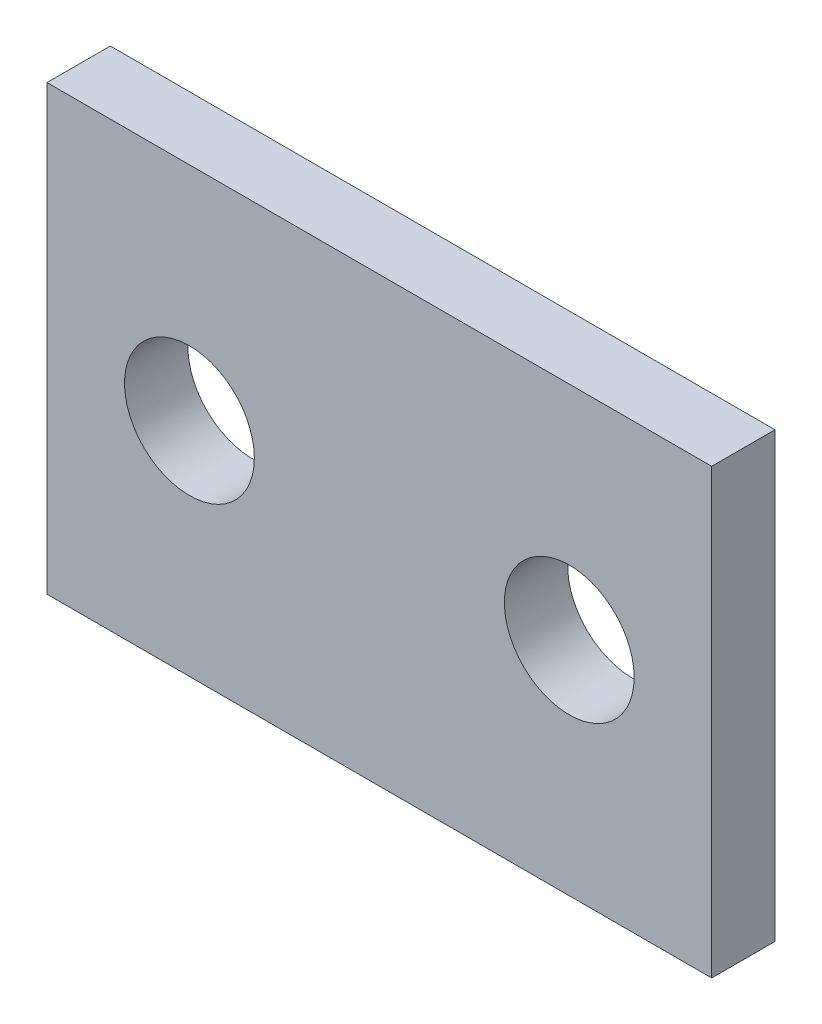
ISO-10303-21;
HEADER;
FILE_DESCRIPTION(('STEP AP214'),'2;1');
FILE_NAME('part.step','',(''),(''),'','','');
FILE_SCHEMA(('AUTOMOTIVE_DESIGN { 1 0 10303 214 1 1 1 1 }'));
ENDSEC;
DATA;
#1=APPLICATION_CONTEXT('core data for automotive mechanical design processes');
#2=APPLICATION_PROTOCOL_DEFINITION('international standard','automotive_design',2000,#1);
#3=PRODUCT_CONTEXT('',#1,'mechanical');
#4=PRODUCT('Part','Part','',(#3));
#5=PRODUCT_RELATED_PRODUCT_CATEGORY('part','',(#4));
#6=PRODUCT_DEFINITION_FORMATION('','',#4);
#7=PRODUCT_DEFINITION_CONTEXT('part definition',#1,'design');
#8=PRODUCT_DEFINITION('design','',#6,#7);
#9=PRODUCT_DEFINITION_SHAPE('','',#8);
#10=(LENGTH_UNIT() NAMED_UNIT(*) SI_UNIT(.MILLI.,.METRE.));
#11=(NAMED_UNIT(*) PLANE_ANGLE_UNIT() SI_UNIT($,.RADIAN.));
#12=(NAMED_UNIT(*) SI_UNIT($,.STERADIAN.) SOLID_ANGLE_UNIT());
#13=UNCERTAINTY_MEASURE_WITH_UNIT(LENGTH_MEASURE(1.E-05),#10,'distance_accuracy_value','');
#14=(GEOMETRIC_REPRESENTATION_CONTEXT(3) GLOBAL_UNCERTAINTY_ASSIGNED_CONTEXT((#13)) GLOBAL_UNIT_ASSIGNED_CONTEXT((#10,
#11,#12)) REPRESENTATION_CONTEXT('',''));
#15=CARTESIAN_POINT('',(0.,0.,0.));
#16=DIRECTION('',(0.,0.,1.));
#17=DIRECTION('',(1.,0.,0.));
#18=AXIS2_PLACEMENT_3D('',#15,#16,#17);
#19=CARTESIAN_POINT('',(0.,0.,10.));
#20=DIRECTION('',(1.,0.,0.));
#21=DIRECTION('',(0.,1.,0.));
#22=AXIS2_PLACEMENT_3D('',#19,#20,#21);
#23=PLANE('',#22);
#24=DIRECTION('',(0.,-1.,0.));
#25=VECTOR('',#24,1.);
#26=CARTESIAN_POINT('',(0.,0.,0.));
#27=LINE('',#26,#25);
#28=CARTESIAN_POINT('',(0.,0.,0.));
#29=VERTEX_POINT('',#28);
#30=CARTESIAN_POINT('',(0.,-70.,0.));
#31=VERTEX_POINT('',#30);
#32=EDGE_CURVE('E393',#29,#31,#27,.T.);
#33=ORIENTED_EDGE('',*,*,#32,.T.);
#34=DIRECTION('',(0.,0.,-1.));
#35=VECTOR('',#34,1.);
#36=CARTESIAN_POINT('',(0.,-70.,10.));
#37=LINE('',#36,#35);
#38=CARTESIAN_POINT('',(0.,-70.,10.));
#39=VERTEX_POINT('',#38);
#40=EDGE_CURVE('E11',#39,#31,#37,.T.);
#41=ORIENTED_EDGE('',*,*,#40,.F.);
#42=DIRECTION('',(0.,-1.,0.));
#43=VECTOR('',#42,1.);
#44=CARTESIAN_POINT('',(0.,0.,10.));
#45=LINE('',#44,#43);
#46=CARTESIAN_POINT('',(0.,0.,10.));
#47=VERTEX_POINT('',#46);
#48=EDGE_CURVE('E416',#47,#39,#45,.T.);
#49=ORIENTED_EDGE('',*,*,#48,.F.);
#50=DIRECTION('',(0.,0.,-1.));
#51=VECTOR('',#50,1.);
#52=CARTESIAN_POINT('',(0.,0.,10.));
#53=LINE('',#52,#51);
#54=EDGE_CURVE('E405',#47,#29,#53,.T.);
#55=ORIENTED_EDGE('',*,*,#54,.T.);
#56=EDGE_LOOP('',(#33,#41,#49,#55));
#57=FACE_BOUND('',#56,.T.);
#58=ADVANCED_FACE('F349',(#57),#23,.F.);
#59=CARTESIAN_POINT('',(0.,-70.,10.));
#60=DIRECTION('',(0.,1.,0.));
#61=DIRECTION('',(0.,0.,1.));
#62=AXIS2_PLACEMENT_3D('',#59,#60,#61);
#63=PLANE('',#62);
#64=DIRECTION('',(1.,0.,0.));
#65=VECTOR('',#64,1.);
#66=CARTESIAN_POINT('',(0.,-70.,0.));
#67=LINE('',#66,#65);
#68=CARTESIAN_POINT('',(105.,-70.,0.));
#69=VERTEX_POINT('',#68);
#70=EDGE_CURVE('E389',#31,#69,#67,.T.);
#71=ORIENTED_EDGE('',*,*,#70,.T.);
#72=DIRECTION('',(0.,0.,-1.));
#73=VECTOR('',#72,1.);
#74=CARTESIAN_POINT('',(105.,-70.,10.));
#75=LINE('',#74,#73);
#76=CARTESIAN_POINT('',(105.,-70.,10.));
#77=VERTEX_POINT('',#76);
#78=EDGE_CURVE('E356',#77,#69,#75,.T.);
#79=ORIENTED_EDGE('',*,*,#78,.F.);
#80=DIRECTION('',(1.,0.,0.));
#81=VECTOR('',#80,1.);
#82=CARTESIAN_POINT('',(0.,-70.,10.));
#83=LINE('',#82,#81);
#84=EDGE_CURVE('E401',#39,#77,#83,.T.);
#85=ORIENTED_EDGE('',*,*,#84,.F.);
#86=ORIENTED_EDGE('',*,*,#40,.T.);
#87=EDGE_LOOP('',(#71,#79,#85,#86));
#88=FACE_BOUND('',#87,.T.);
#89=ADVANCED_FACE('F400',(#88),#63,.F.);
#90=CARTESIAN_POINT('',(105.,0.,10.));
#91=DIRECTION('',(-1.,0.,0.));
#92=DIRECTION('',(0.,-1.,0.));
#93=AXIS2_PLACEMENT_3D('',#90,#91,#92);
#94=PLANE('',#93);
#95=DIRECTION('',(0.,1.,0.));
#96=VECTOR('',#95,1.);
#97=CARTESIAN_POINT('',(105.,0.,0.));
#98=LINE('',#97,#96);
#99=CARTESIAN_POINT('',(105.,0.,0.));
#100=VERTEX_POINT('',#99);
#101=EDGE_CURVE('E394',#69,#100,#98,.T.);
#102=ORIENTED_EDGE('',*,*,#101,.T.);
#103=DIRECTION('',(0.,0.,-1.));
#104=VECTOR('',#103,1.);
#105=CARTESIAN_POINT('',(105.,0.,10.));
#106=LINE('',#105,#104);
#107=CARTESIAN_POINT('',(105.,0.,10.));
#108=VERTEX_POINT('',#107);
#109=EDGE_CURVE('E422',#108,#100,#106,.T.);
#110=ORIENTED_EDGE('',*,*,#109,.F.);
#111=DIRECTION('',(0.,1.,0.));
#112=VECTOR('',#111,1.);
#113=CARTESIAN_POINT('',(105.,0.,10.));
#114=LINE('',#113,#112);
#115=EDGE_CURVE('E368',#77,#108,#114,.T.);
#116=ORIENTED_EDGE('',*,*,#115,.F.);
#117=ORIENTED_EDGE('',*,*,#78,.T.);
#118=EDGE_LOOP('',(#102,#110,#116,#117));
#119=FACE_BOUND('',#118,.T.);
#120=ADVANCED_FACE('F425',(#119),#94,.F.);
#121=CARTESIAN_POINT('',(0.,0.,10.));
#122=DIRECTION('',(0.,-1.,0.));
#123=DIRECTION('',(0.,0.,-1.));
#124=AXIS2_PLACEMENT_3D('',#121,#122,#123);
#125=PLANE('',#124);
#126=DIRECTION('',(-1.,0.,0.));
#127=VECTOR('',#126,1.);
#128=CARTESIAN_POINT('',(0.,0.,0.));
#129=LINE('',#128,#127);
#130=EDGE_CURVE('E414',#100,#29,#129,.T.);
#131=ORIENTED_EDGE('',*,*,#130,.T.);
#132=ORIENTED_EDGE('',*,*,#54,.F.);
#133=DIRECTION('',(-1.,0.,0.));
#134=VECTOR('',#133,1.);
#135=CARTESIAN_POINT('',(0.,0.,10.));
#136=LINE('',#135,#134);
#137=EDGE_CURVE('E363',#108,#47,#136,.T.);
#138=ORIENTED_EDGE('',*,*,#137,.F.);
#139=ORIENTED_EDGE('',*,*,#109,.T.);
#140=EDGE_LOOP('',(#131,#132,#138,#139));
#141=FACE_BOUND('',#140,.T.);
#142=ADVANCED_FACE('F427',(#141),#125,.F.);
#143=CARTESIAN_POINT('',(0.,-70.,10.));
#144=DIRECTION('',(0.,0.,1.));
#145=DIRECTION('',(1.,0.,0.));
#146=AXIS2_PLACEMENT_3D('',#143,#144,#145);
#147=PLANE('',#146);
#148=CARTESIAN_POINT('',(82.5,-35.,10.));
#149=DIRECTION('',(0.,0.,1.));
#150=DIRECTION('',(1.,0.,0.));
#151=AXIS2_PLACEMENT_3D('',#148,#149,#150);
#152=CIRCLE('',#151,10.25);
#153=CARTESIAN_POINT('',(92.75,-35.,10.));
#154=VERTEX_POINT('',#153);
#155=EDGE_CURVE('E484',#154,#154,#152,.T.);
#156=ORIENTED_EDGE('',*,*,#155,.F.);
#157=EDGE_LOOP('',(#156));
#158=FACE_BOUND('',#157,.T.);
#159=CARTESIAN_POINT('',(22.5,-35.,10.));
#160=DIRECTION('',(0.,0.,1.));
#161=DIRECTION('',(1.,0.,0.));
#162=AXIS2_PLACEMENT_3D('',#159,#160,#161);
#163=CIRCLE('',#162,10.25);
#164=CARTESIAN_POINT('',(32.75,-35.,10.));
#165=VERTEX_POINT('',#164);
#166=EDGE_CURVE('E409',#165,#165,#163,.T.);
#167=ORIENTED_EDGE('',*,*,#166,.F.);
#168=EDGE_LOOP('',(#167));
#169=FACE_BOUND('',#168,.T.);
#170=ORIENTED_EDGE('',*,*,#48,.T.);
#171=ORIENTED_EDGE('',*,*,#84,.T.);
#172=ORIENTED_EDGE('',*,*,#115,.T.);
#173=ORIENTED_EDGE('',*,*,#137,.T.);
#174=EDGE_LOOP('',(#170,#171,#172,#173));
#175=FACE_BOUND('',#174,.T.);
#176=ADVANCED_FACE('F428',(#158,#169,#175),#147,.T.);
#177=CARTESIAN_POINT('',(0.,-70.,0.));
#178=DIRECTION('',(0.,0.,1.));
#179=DIRECTION('',(1.,0.,0.));
#180=AXIS2_PLACEMENT_3D('',#177,#178,#179);
#181=PLANE('',#180);
#182=CARTESIAN_POINT('',(82.5,-35.,0.));
#183=DIRECTION('',(0.,0.,1.));
#184=DIRECTION('',(1.,0.,0.));
#185=AXIS2_PLACEMENT_3D('',#182,#183,#184);
#186=CIRCLE('',#185,10.25);
#187=CARTESIAN_POINT('',(92.75,-35.,0.));
#188=VERTEX_POINT('',#187);
#189=EDGE_CURVE('E482',#188,#188,#186,.T.);
#190=ORIENTED_EDGE('',*,*,#189,.T.);
#191=EDGE_LOOP('',(#190));
#192=FACE_BOUND('',#191,.T.);
#193=CARTESIAN_POINT('',(22.5,-35.,0.));
#194=DIRECTION('',(0.,0.,1.));
#195=DIRECTION('',(1.,0.,0.));
#196=AXIS2_PLACEMENT_3D('',#193,#194,#195);
#197=CIRCLE('',#196,10.25);
#198=CARTESIAN_POINT('',(32.75,-35.,0.));
#199=VERTEX_POINT('',#198);
#200=EDGE_CURVE('E406',#199,#199,#197,.T.);
#201=ORIENTED_EDGE('',*,*,#200,.T.);
#202=EDGE_LOOP('',(#201));
#203=FACE_BOUND('',#202,.T.);
#204=ORIENTED_EDGE('',*,*,#32,.F.);
#205=ORIENTED_EDGE('',*,*,#130,.F.);
#206=ORIENTED_EDGE('',*,*,#101,.F.);
#207=ORIENTED_EDGE('',*,*,#70,.F.);
#208=EDGE_LOOP('',(#204,#205,#206,#207));
#209=FACE_BOUND('',#208,.T.);
#210=ADVANCED_FACE('F390',(#192,#203,#209),#181,.F.);
#211=CARTESIAN_POINT('',(22.5,-35.,0.));
#212=DIRECTION('',(0.,0.,1.));
#213=DIRECTION('',(1.,0.,0.));
#214=AXIS2_PLACEMENT_3D('',#211,#212,#213);
#215=CYLINDRICAL_SURFACE('',#214,10.25);
#216=ORIENTED_EDGE('',*,*,#200,.F.);
#217=EDGE_LOOP('',(#216));
#218=FACE_BOUND('',#217,.T.);
#219=ORIENTED_EDGE('',*,*,#166,.T.);
#220=EDGE_LOOP('',(#219));
#221=FACE_BOUND('',#220,.T.);
#222=ADVANCED_FACE('F436',(#218,#221),#215,.F.);
#223=CARTESIAN_POINT('',(82.5,-35.,0.));
#224=DIRECTION('',(0.,0.,1.));
#225=DIRECTION('',(1.,0.,0.));
#226=AXIS2_PLACEMENT_3D('',#223,#224,#225);
#227=CYLINDRICAL_SURFACE('',#226,10.25);
#228=ORIENTED_EDGE('',*,*,#189,.F.);
#229=EDGE_LOOP('',(#228));
#230=FACE_BOUND('',#229,.T.);
#231=ORIENTED_EDGE('',*,*,#155,.T.);
#232=EDGE_LOOP('',(#231));
#233=FACE_BOUND('',#232,.T.);
#234=ADVANCED_FACE('F469',(#230,#233),#227,.F.);
#235=CLOSED_SHELL('',(#58,#89,#120,#142,#176,#210,#222,#234));
#236=MANIFOLD_SOLID_BREP('B2',#235);
#237=ADVANCED_BREP_SHAPE_REPRESENTATION('',(#18,#236),#14);
#238=SHAPE_DEFINITION_REPRESENTATION(#9,#237);
ENDSEC;
END-ISO-10303-21;
